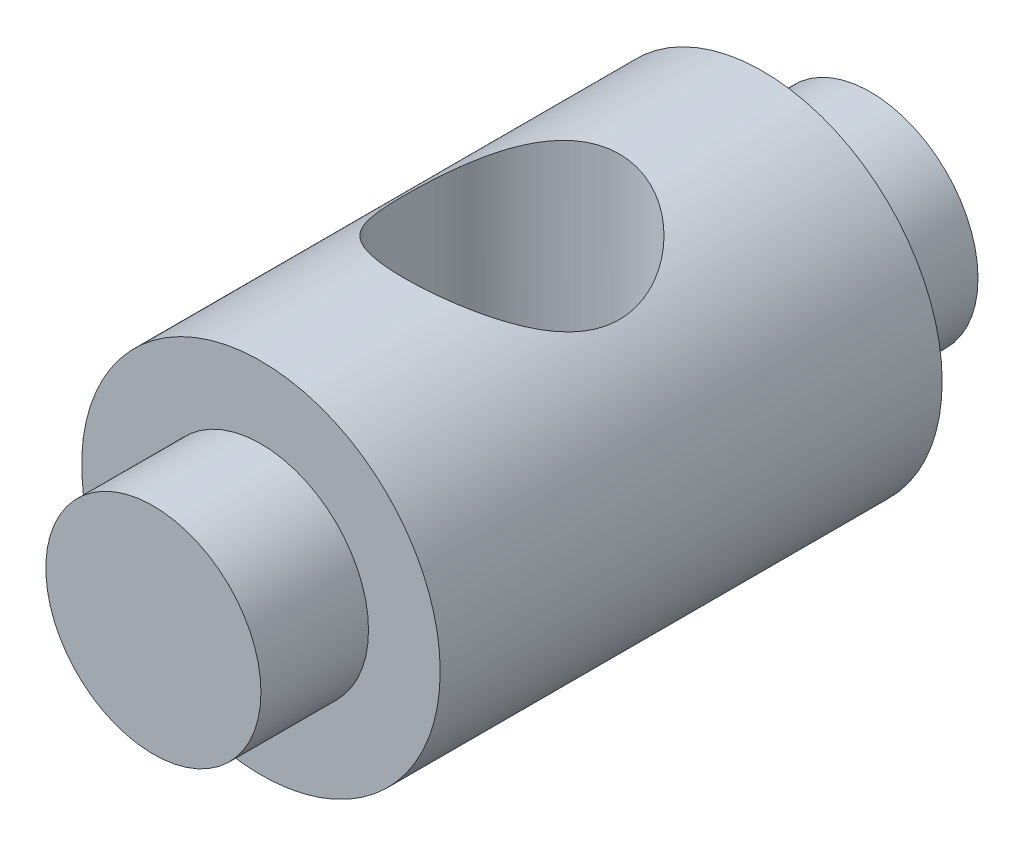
from build123d import *

# Parameters (mm, degrees)
BOSS_EXTRUDE1_DEPTH      = 7
BOSS_EXTRUDE1_DEPTH_BACK = 7
SKETCH1_R                = 5
SKETCH2_R                = 3
BOSS_EXTRUDE2_DEPTH      = 3
SKETCH3_R                = 3
CUT_EXTRUDE1_DEPTH       = 5


with BuildPart() as part:
    # Sketch1 → Boss-Extrude1 (new, two sides: drawn at the far end of the back side and taken through both)
    with BuildSketch(Plane.XY.offset(-BOSS_EXTRUDE1_DEPTH_BACK)):
        Circle(SKETCH1_R)
    extrude(amount=BOSS_EXTRUDE1_DEPTH + BOSS_EXTRUDE1_DEPTH_BACK)

    # Sketch2 → Boss-Extrude2 (add)
    with BuildSketch(Plane.XY.offset(7)):
        Circle(SKETCH2_R)
    boss_extrude2 = extrude(amount=BOSS_EXTRUDE2_DEPTH)

    # Mirror1: Boss-Extrude2 across plane
    add(boss_extrude2.mirror(Plane.XY))

    # Sketch3 → Cut-Extrude1 (cut)
    with BuildSketch(Plane(origin=(0, 5, 0), x_dir=(1, 0, 0), z_dir=(0, 1, 0))):
        with Locations(Location((0, 0, 0), (0, 0, 270))):
            Circle(SKETCH3_R)
    extrude(amount=-CUT_EXTRUDE1_DEPTH, mode=Mode.SUBTRACT)


solid = part.part
